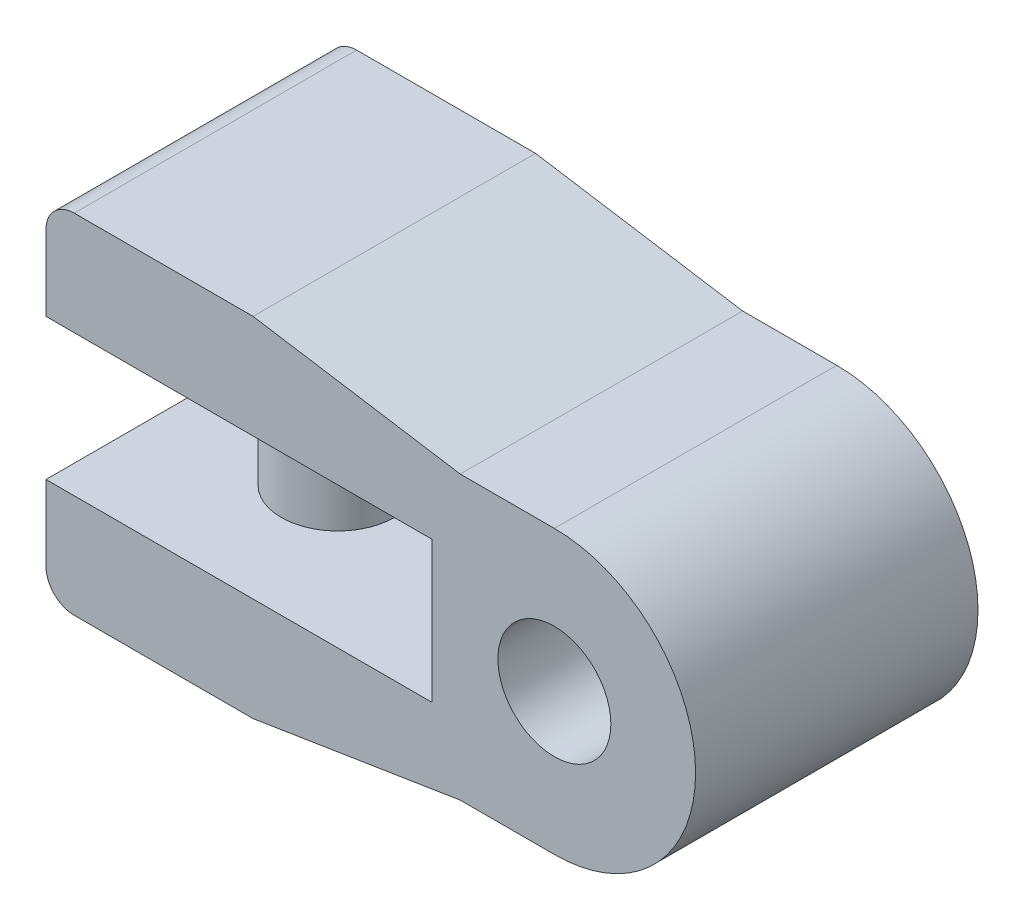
from build123d import *

# Parameters (mm, degrees)
BASE_EXTRUSION_DEPTH    = 30
ESQUISSE2_R             = 6
ENL_V_MAT_EXTRU_1_DEPTH = 78.480642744
CONG_1_R                = 3
BOSS_EXTRU_2_REACH      = 85.845
ESQUISSE3_R             = 6


with BuildPart() as part:
    # Esquisse1 → Base-Extrusion (new body)
    with BuildSketch(Plane.XY):
        with BuildLine():
            Line((41, -7.5), (41, 7.5))
            Line((41, 7.5), (0, 7.5))
            Line((0, 7.5), (0, 18.5))
            Line((0, 18.5), (22, 18.5))
            Line((22, 18.5), (44, 15))
            Line((44, 15), (54, 15))
            ThreePointArc((54, 15), (69, 0), (54, -15))
            Line((54, -15), (44, -15))
            Line((44, -15), (22, -18.5))
            Line((22, -18.5), (0, -18.5))
            Line((0, -18.5), (0, -7.5))
            Line((0, -7.5), (41, -7.5))
        make_face()
    extrude(amount=BASE_EXTRUSION_DEPTH)

    # Esquisse2 → Enl_v. mat.-Extru.1 (cut, through all)
    with BuildSketch(Plane.XY.offset(30)):
        with Locations((54, 0)):
            Circle(ESQUISSE2_R)
    extrude(amount=-ENL_V_MAT_EXTRU_1_DEPTH, mode=Mode.SUBTRACT)

    # Cong_1
    cong_1_edges = [part.edges().sort_by_distance(p)[0] for p in [
        (0, 18.5, 15),
        (0, -18.5, 15),
    ]]
    fillet(cong_1_edges, radius=CONG_1_R)

    # Esquisse3 → Boss.-Extru.2 (add, up to next)
    with BuildSketch(Plane(origin=(0, 18.5, 0), x_dir=(-1, 0, 0), z_dir=(0, 1, 0)), mode=Mode.PRIVATE) as boss_extru_2_sk1:
        with Locations(Location((-16, 15, 0), (0, 0, 180))):
            Circle(ESQUISSE3_R)
    boss_extru_2_tool1 = extrude(boss_extru_2_sk1.sketch, amount=-BOSS_EXTRU_2_REACH, mode=Mode.PRIVATE) - part.part
    add(boss_extru_2_tool1.solids().sort_by_distance((16, 18.5, 15))[0])


solid = part.part
